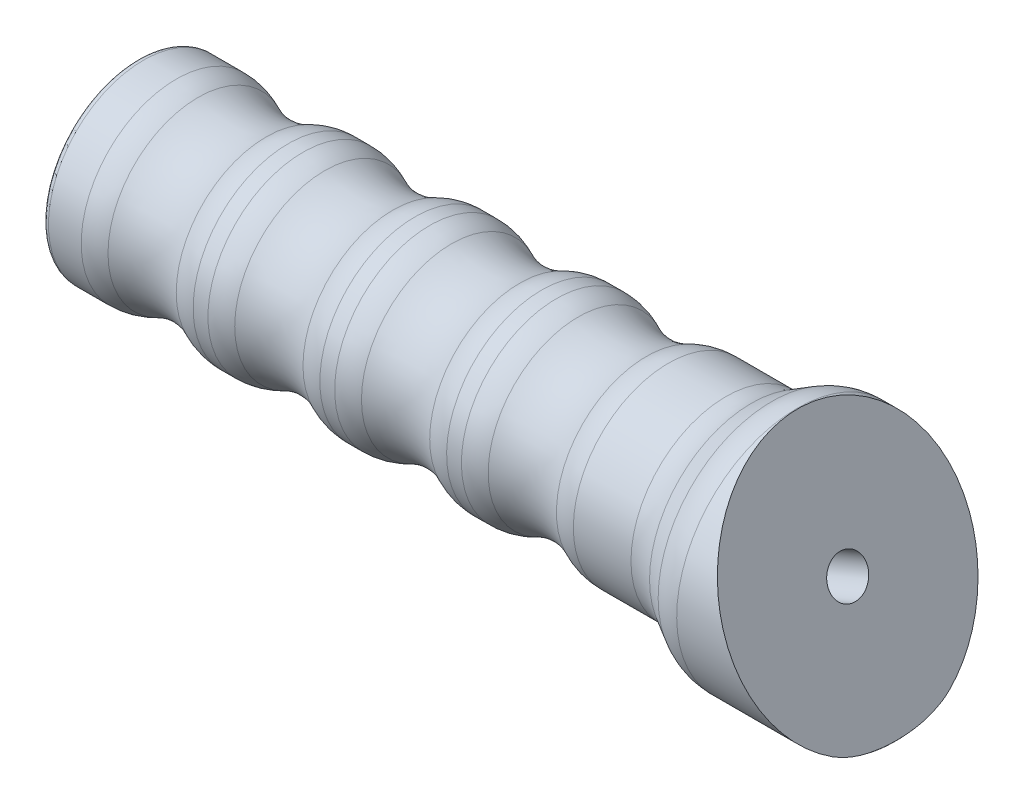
ISO-10303-21;
HEADER;
FILE_DESCRIPTION(('STEP AP214'),'2;1');
FILE_NAME('part.step','',(''),(''),'','','');
FILE_SCHEMA(('AUTOMOTIVE_DESIGN { 1 0 10303 214 1 1 1 1 }'));
ENDSEC;
DATA;
#1=APPLICATION_CONTEXT('core data for automotive mechanical design processes');
#2=APPLICATION_PROTOCOL_DEFINITION('international standard','automotive_design',2000,#1);
#3=PRODUCT_CONTEXT('',#1,'mechanical');
#4=PRODUCT('Part','Part','',(#3));
#5=PRODUCT_RELATED_PRODUCT_CATEGORY('part','',(#4));
#6=PRODUCT_DEFINITION_FORMATION('','',#4);
#7=PRODUCT_DEFINITION_CONTEXT('part definition',#1,'design');
#8=PRODUCT_DEFINITION('design','',#6,#7);
#9=PRODUCT_DEFINITION_SHAPE('','',#8);
#10=(LENGTH_UNIT() NAMED_UNIT(*) SI_UNIT(.MILLI.,.METRE.));
#11=(NAMED_UNIT(*) PLANE_ANGLE_UNIT() SI_UNIT($,.RADIAN.));
#12=(NAMED_UNIT(*) SI_UNIT($,.STERADIAN.) SOLID_ANGLE_UNIT());
#13=UNCERTAINTY_MEASURE_WITH_UNIT(LENGTH_MEASURE(1.E-05),#10,'distance_accuracy_value','');
#14=(GEOMETRIC_REPRESENTATION_CONTEXT(3) GLOBAL_UNCERTAINTY_ASSIGNED_CONTEXT((#13)) GLOBAL_UNIT_ASSIGNED_CONTEXT((#10,
#11,#12)) REPRESENTATION_CONTEXT('',''));
#15=CARTESIAN_POINT('',(0.,0.,0.));
#16=DIRECTION('',(0.,0.,1.));
#17=DIRECTION('',(1.,0.,0.));
#18=AXIS2_PLACEMENT_3D('',#15,#16,#17);
#19=CARTESIAN_POINT('',(0.,0.,0.));
#20=DIRECTION('',(-1.,0.,0.));
#21=DIRECTION('',(0.,0.,1.));
#22=AXIS2_PLACEMENT_3D('',#19,#20,#21);
#23=CYLINDRICAL_SURFACE('',#22,15.);
#24=CARTESIAN_POINT('',(92.9282032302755,0.,0.));
#25=DIRECTION('',(-1.,0.,0.));
#26=DIRECTION('',(0.,0.,1.));
#27=AXIS2_PLACEMENT_3D('',#24,#25,#26);
#28=CIRCLE('',#27,15.);
#29=CARTESIAN_POINT('',(92.9282032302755,0.,15.));
#30=VERTEX_POINT('',#29);
#31=EDGE_CURVE('E321',#30,#30,#28,.T.);
#32=ORIENTED_EDGE('',*,*,#31,.T.);
#33=EDGE_LOOP('',(#32));
#34=FACE_BOUND('',#33,.T.);
#35=CARTESIAN_POINT('',(83.8317608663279,-14.1318424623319,-5.02901865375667));
#36=CARTESIAN_POINT('',(83.9859479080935,-14.1427237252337,-4.99843191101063));
#37=CARTESIAN_POINT('',(84.1397389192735,-14.1541565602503,-4.96599996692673));
#38=CARTESIAN_POINT('',(84.4463662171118,-14.1781353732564,-4.89712498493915));
#39=CARTESIAN_POINT('',(84.5992022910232,-14.190681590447,-4.86068108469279));
#40=CARTESIAN_POINT('',(84.9042731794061,-14.2169426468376,-4.78332665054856));
#41=CARTESIAN_POINT('',(85.0565034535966,-14.2306617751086,-4.74239955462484));
#42=CARTESIAN_POINT('',(85.3594961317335,-14.2592185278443,-4.65583008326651));
#43=CARTESIAN_POINT('',(85.510258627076,-14.2740560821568,-4.61018800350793));
#44=CARTESIAN_POINT('',(85.96396634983,-14.3206395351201,-4.46429182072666));
#45=CARTESIAN_POINT('',(86.2642400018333,-14.3541050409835,-4.35607868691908));
#46=CARTESIAN_POINT('',(86.8537919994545,-14.425121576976,-4.11481943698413));
#47=CARTESIAN_POINT('',(87.1430881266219,-14.4626655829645,-3.98181574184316));
#48=CARTESIAN_POINT('',(87.5546196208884,-14.5198549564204,-3.76546878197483));
#49=CARTESIAN_POINT('',(87.6831893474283,-14.5382926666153,-3.69378166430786));
#50=CARTESIAN_POINT('',(87.9361637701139,-14.5756620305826,-3.54345827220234));
#51=CARTESIAN_POINT('',(88.060568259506,-14.5945937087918,-3.46482165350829));
#52=CARTESIAN_POINT('',(88.3041998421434,-14.6327151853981,-3.30011846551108));
#53=CARTESIAN_POINT('',(88.4234307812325,-14.6519047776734,-3.21405756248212));
#54=CARTESIAN_POINT('',(88.6557008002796,-14.6902648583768,-3.03390859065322));
#55=CARTESIAN_POINT('',(88.7687399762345,-14.7094353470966,-2.93982064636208));
#56=CARTESIAN_POINT('',(88.9890586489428,-14.7476941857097,-2.74151039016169));
#57=CARTESIAN_POINT('',(89.0962132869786,-14.7667760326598,-2.63714718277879));
#58=CARTESIAN_POINT('',(89.3010036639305,-14.8040394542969,-2.41922221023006));
#59=CARTESIAN_POINT('',(89.3986376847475,-14.8222208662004,-2.30565879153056));
#60=CARTESIAN_POINT('',(89.5820187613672,-14.857016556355,-2.06959734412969));
#61=CARTESIAN_POINT('',(89.6678026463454,-14.8736356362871,-1.94712888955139));
#62=CARTESIAN_POINT('',(89.8254638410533,-14.9046573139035,-1.69337505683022));
#63=CARTESIAN_POINT('',(89.8973523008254,-14.9190616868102,-1.56209686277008));
#64=CARTESIAN_POINT('',(90.0396019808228,-14.9479051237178,-1.26018033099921));
#65=CARTESIAN_POINT('',(90.1057805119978,-14.9615847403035,-1.08745117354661));
#66=CARTESIAN_POINT('',(90.2091298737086,-14.9831193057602,-0.733180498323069));
#67=CARTESIAN_POINT('',(90.2463198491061,-14.9909780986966,-0.551644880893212));
#68=CARTESIAN_POINT('',(90.2889738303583,-15.0000018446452,-0.183965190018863));
#69=CARTESIAN_POINT('',(90.2943202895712,-15.0011419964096,0.00219341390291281));
#70=CARTESIAN_POINT('',(90.2725113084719,-14.9965180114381,0.372498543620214));
#71=CARTESIAN_POINT('',(90.2453521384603,-14.9907530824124,0.556644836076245));
#72=CARTESIAN_POINT('',(90.162794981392,-14.9734426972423,0.908633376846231));
#73=CARTESIAN_POINT('',(90.1088295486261,-14.9621909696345,1.07683325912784));
#74=CARTESIAN_POINT('',(89.976911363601,-14.9351353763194,1.40306137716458));
#75=CARTESIAN_POINT('',(89.898949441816,-14.9193297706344,1.56108569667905));
#76=CARTESIAN_POINT('',(89.6829860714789,-14.8764540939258,1.93406859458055));
#77=CARTESIAN_POINT('',(89.5337932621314,-14.8475269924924,2.14232506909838));
#78=CARTESIAN_POINT('',(89.2043438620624,-14.7860906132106,2.53193514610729));
#79=CARTESIAN_POINT('',(89.024025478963,-14.7535742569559,2.71323387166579));
#80=CARTESIAN_POINT('',(88.6836597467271,-14.6948570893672,3.01314095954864));
#81=CARTESIAN_POINT('',(88.5279015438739,-14.6688435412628,3.13676014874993));
#82=CARTESIAN_POINT('',(88.2060368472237,-14.617048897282,3.36989061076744));
#83=CARTESIAN_POINT('',(88.0399239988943,-14.5912679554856,3.47939309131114));
#84=CARTESIAN_POINT('',(87.6990643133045,-14.5404415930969,3.68604471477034));
#85=CARTESIAN_POINT('',(87.524280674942,-14.5154001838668,3.78313358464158));
#86=CARTESIAN_POINT('',(87.1685748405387,-14.4665792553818,3.96572876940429));
#87=CARTESIAN_POINT('',(86.9876508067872,-14.4428001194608,4.05123157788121));
#88=CARTESIAN_POINT('',(86.5652829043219,-14.3897718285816,4.23631683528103));
#89=CARTESIAN_POINT('',(86.322181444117,-14.3610610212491,4.33226223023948));
#90=CARTESIAN_POINT('',(85.8300989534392,-14.3065766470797,4.50892267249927));
#91=CARTESIAN_POINT('',(85.5811145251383,-14.2808048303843,4.58962866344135));
#92=CARTESIAN_POINT('',(85.0834608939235,-14.2327865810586,4.73641588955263));
#93=CARTESIAN_POINT('',(84.8348663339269,-14.210485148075,4.80273374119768));
#94=CARTESIAN_POINT('',(84.4599652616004,-14.1793001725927,4.89371641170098));
#95=CARTESIAN_POINT('',(84.3347559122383,-14.1692895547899,4.92261020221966));
#96=CARTESIAN_POINT('',(84.0837091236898,-14.1500109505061,4.97775438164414));
#97=CARTESIAN_POINT('',(83.9578717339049,-14.1407429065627,5.00400497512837));
#98=CARTESIAN_POINT('',(83.8317608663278,-14.131842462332,5.02901865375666));
#99=B_SPLINE_CURVE_WITH_KNOTS('',3,(#35,#36,#37,#38,#39,#40,#41,#42,#43,#44,#45,#46,#47,#48,#49,
#50,#51,#52,#53,#54,#55,#56,#57,#58,#59,#60,#61,#62,#63,#64,#65,#66,#67,#68,#69,#70,#71,#72,#73,
#74,#75,#76,#77,#78,#79,#80,#81,#82,#83,#84,#85,#86,#87,#88,#89,#90,#91,#92,#93,#94,#95,#96,#97,
#98),.UNSPECIFIED.,.F.,.F.,(4,2,2,2,2,2,2,2,2,2,2,2,2,2,2,2,2,2,2,2,2,2,2,2,2,2,2,2,2,2,2,4),
(0.,0.472703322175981,0.945508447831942,1.42012322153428,1.89470825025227,2.85654037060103,
3.81674149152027,4.26162743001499,4.70653541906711,5.15110680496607,5.59567129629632,
6.04752650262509,6.49946310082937,6.94996190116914,7.40009769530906,7.95413522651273,
8.50780654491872,9.0635204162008,9.61929805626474,10.148136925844,10.67717812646,
11.4462751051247,12.2169168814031,12.8177390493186,13.4189336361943,14.022944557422,
14.6271378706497,15.4152517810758,16.2038325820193,16.9782512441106,17.3648939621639,
17.7515067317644),.UNSPECIFIED.);
#100=CARTESIAN_POINT('',(83.8317608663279,-14.1318424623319,-5.02901865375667));
#101=VERTEX_POINT('',#100);
#102=CARTESIAN_POINT('',(83.8317608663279,-14.1318424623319,5.02901865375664));
#103=VERTEX_POINT('',#102);
#104=EDGE_CURVE('E186',#101,#103,#99,.T.);
#105=ORIENTED_EDGE('',*,*,#104,.F.);
#106=CARTESIAN_POINT('',(83.8317608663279,0.,0.));
#107=DIRECTION('',(1.,0.,0.));
#108=DIRECTION('',(0.,0.,-1.));
#109=AXIS2_PLACEMENT_3D('',#106,#107,#108);
#110=CIRCLE('',#109,15.);
#111=EDGE_CURVE('E318',#101,#103,#110,.T.);
#112=ORIENTED_EDGE('',*,*,#111,.T.);
#113=EDGE_LOOP('',(#105,#112));
#114=FACE_BOUND('',#113,.T.);
#115=ADVANCED_FACE('F32',(#34,#114),#23,.T.);
#116=CARTESIAN_POINT('',(75.,0.,0.));
#117=DIRECTION('',(-1.,0.,0.));
#118=DIRECTION('',(0.,0.,1.));
#119=AXIS2_PLACEMENT_3D('',#116,#117,#118);
#120=TOROIDAL_SURFACE('',#119,25.5,12.5);
#121=CARTESIAN_POINT('',(80.3854200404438,-13.1129079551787,5.49989885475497));
#122=CARTESIAN_POINT('',(80.2801782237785,-13.0586427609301,5.49934921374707));
#123=CARTESIAN_POINT('',(80.1737990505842,-13.0066538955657,5.49658331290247));
#124=CARTESIAN_POINT('',(79.9591242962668,-12.9073040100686,5.48709815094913));
#125=CARTESIAN_POINT('',(79.8508295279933,-12.8599410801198,5.48038052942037));
#126=CARTESIAN_POINT('',(79.6329002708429,-12.7699995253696,5.46349356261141));
#127=CARTESIAN_POINT('',(79.5232703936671,-12.7274078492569,5.45333395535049));
#128=CARTESIAN_POINT('',(79.3026460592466,-12.646827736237,5.4300096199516));
#129=CARTESIAN_POINT('',(79.1916514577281,-12.60883979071,5.4168445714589));
#130=CARTESIAN_POINT('',(78.8596620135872,-12.5025469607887,5.3738360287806));
#131=CARTESIAN_POINT('',(78.6370105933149,-12.4408279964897,5.34025278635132));
#132=CARTESIAN_POINT('',(78.1887813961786,-12.3342224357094,5.26599919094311));
#133=CARTESIAN_POINT('',(77.9632012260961,-12.2893506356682,5.22532265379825));
#134=CARTESIAN_POINT('',(77.4166793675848,-12.2000470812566,5.12166789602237));
#135=CARTESIAN_POINT('',(77.0948776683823,-12.1634702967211,5.05642311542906));
#136=CARTESIAN_POINT('',(76.4500611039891,-12.1185366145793,4.92273360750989));
#137=CARTESIAN_POINT('',(76.1270459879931,-12.1101859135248,4.85428818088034));
#138=CARTESIAN_POINT('',(75.4785828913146,-12.1189279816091,4.71841436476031));
#139=CARTESIAN_POINT('',(75.1531353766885,-12.1362176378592,4.65099790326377));
#140=CARTESIAN_POINT('',(74.503202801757,-12.1944117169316,4.52196858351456));
#141=CARTESIAN_POINT('',(74.178717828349,-12.235318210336,4.46035623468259));
#142=CARTESIAN_POINT('',(73.4904314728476,-12.345821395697,4.33965688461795));
#143=CARTESIAN_POINT('',(73.1268738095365,-12.4184033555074,4.28188573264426));
#144=CARTESIAN_POINT('',(72.4037231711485,-12.5902668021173,4.18404098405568));
#145=CARTESIAN_POINT('',(72.0441288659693,-12.6895390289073,4.14396126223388));
#146=CARTESIAN_POINT('',(71.5109561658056,-12.8573971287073,4.10052904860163));
#147=CARTESIAN_POINT('',(71.3349243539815,-12.9162495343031,4.08884600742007));
#148=CARTESIAN_POINT('',(70.98478992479,-13.0402550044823,4.07128898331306));
#149=CARTESIAN_POINT('',(70.8106872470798,-13.1054078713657,4.06541481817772));
#150=CARTESIAN_POINT('',(70.464582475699,-13.2420347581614,4.05974095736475));
#151=CARTESIAN_POINT('',(70.2925838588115,-13.3135179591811,4.05995023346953));
#152=CARTESIAN_POINT('',(69.9513727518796,-13.4626568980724,4.06651076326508));
#153=CARTESIAN_POINT('',(69.7821606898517,-13.5403135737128,4.07286295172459));
#154=CARTESIAN_POINT('',(69.6145799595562,-13.6210129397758,4.08230926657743));
#155=B_SPLINE_CURVE_WITH_KNOTS('',3,(#121,#122,#123,#124,#125,#126,#127,#128,#129,#130,#131,
#132,#133,#134,#135,#136,#137,#138,#139,#140,#141,#142,#143,#144,#145,#146,#147,#148,#149,#150,
#151,#152,#153,#154),.UNSPECIFIED.,.F.,.F.,(4,2,2,2,2,2,2,2,2,2,2,2,2,2,2,2,4),(0.,
0.355148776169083,0.710150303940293,1.0641557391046,1.41819892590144,2.11769816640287,
2.81781033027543,3.80743247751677,4.79727186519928,5.79475149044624,6.79231858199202,
7.91665266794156,9.04059717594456,9.59835472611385,10.1560947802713,10.7146574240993,
11.2733050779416),.UNSPECIFIED.);
#156=CARTESIAN_POINT('',(80.3852200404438,-13.1128048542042,5.49989781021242));
#157=VERTEX_POINT('',#156);
#158=CARTESIAN_POINT('',(69.6147799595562,-13.6209166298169,4.08229803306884));
#159=VERTEX_POINT('',#158);
#160=EDGE_CURVE('E52',#157,#159,#155,.T.);
#161=ORIENTED_EDGE('',*,*,#160,.F.);
#162=CARTESIAN_POINT('',(80.3852200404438,0.,0.));
#163=DIRECTION('',(-1.,0.,0.));
#164=DIRECTION('',(0.,0.,1.));
#165=AXIS2_PLACEMENT_3D('',#162,#163,#164);
#166=CIRCLE('',#165,14.2195121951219);
#167=CARTESIAN_POINT('',(80.3852200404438,-13.1128048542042,-5.49989781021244));
#168=VERTEX_POINT('',#167);
#169=EDGE_CURVE('E116',#157,#168,#166,.T.);
#170=ORIENTED_EDGE('',*,*,#169,.T.);
#171=CARTESIAN_POINT('',(69.6145799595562,-13.6210129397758,-4.08230926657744));
#172=CARTESIAN_POINT('',(69.7632804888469,-13.5494051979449,-4.07393583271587));
#173=CARTESIAN_POINT('',(69.9132663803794,-13.4801930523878,-4.06798794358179));
#174=CARTESIAN_POINT('',(70.215478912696,-13.3466207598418,-4.06093065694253));
#175=CARTESIAN_POINT('',(70.3677053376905,-13.2822601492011,-4.05982079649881));
#176=CARTESIAN_POINT('',(70.6739255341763,-13.1585075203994,-4.06242390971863));
#177=CARTESIAN_POINT('',(70.8279171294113,-13.0991100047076,-4.06613146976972));
#178=CARTESIAN_POINT('',(71.1375281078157,-12.9852595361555,-4.07820353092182));
#179=CARTESIAN_POINT('',(71.2931475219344,-12.9308066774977,-4.08656812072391));
#180=CARTESIAN_POINT('',(71.7619014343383,-12.7749879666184,-4.11830601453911));
#181=CARTESIAN_POINT('',(72.077118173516,-12.6810867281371,-4.14832552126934));
#182=CARTESIAN_POINT('',(72.711182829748,-12.5137310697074,-4.22334682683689));
#183=CARTESIAN_POINT('',(73.0300317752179,-12.4402825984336,-4.26835297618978));
#184=CARTESIAN_POINT('',(73.6790733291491,-12.3128105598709,-4.37132461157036));
#185=CARTESIAN_POINT('',(74.0093324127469,-12.259392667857,-4.42961953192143));
#186=CARTESIAN_POINT('',(74.6713425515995,-12.1762594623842,-4.55434529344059));
#187=CARTESIAN_POINT('',(75.0030938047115,-12.1465473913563,-4.62077724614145));
#188=CARTESIAN_POINT('',(75.6673621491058,-12.1127955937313,-4.75749202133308));
#189=CARTESIAN_POINT('',(75.9998795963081,-12.1087724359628,-4.82777729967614));
#190=CARTESIAN_POINT('',(76.6642108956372,-12.1291811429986,-4.96733467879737));
#191=CARTESIAN_POINT('',(76.9960250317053,-12.1535975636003,-5.03660730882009));
#192=CARTESIAN_POINT('',(77.5479011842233,-12.2209040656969,-5.14659030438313));
#193=CARTESIAN_POINT('',(77.7686681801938,-12.2550264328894,-5.18917624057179));
#194=CARTESIAN_POINT('',(78.2083133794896,-12.3386297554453,-5.26919969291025));
#195=CARTESIAN_POINT('',(78.4271913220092,-12.3881127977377,-5.30663650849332));
#196=CARTESIAN_POINT('',(78.8607758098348,-12.5031429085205,-5.37371136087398));
#197=CARTESIAN_POINT('',(79.0754974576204,-12.568610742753,-5.40338641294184));
#198=CARTESIAN_POINT('',(79.5001889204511,-12.716402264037,-5.45230367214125));
#199=CARTESIAN_POINT('',(79.7101629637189,-12.7987102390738,-5.47155554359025));
#200=CARTESIAN_POINT('',(79.9958968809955,-12.9242268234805,-5.48877518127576));
#201=CARTESIAN_POINT('',(80.0745353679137,-12.9602276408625,-5.49254632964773));
#202=CARTESIAN_POINT('',(80.2307902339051,-13.0347153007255,-5.49790837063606));
#203=CARTESIAN_POINT('',(80.3084055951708,-13.0732044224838,-5.49949723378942));
#204=CARTESIAN_POINT('',(80.3854200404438,-13.1129079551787,-5.49989885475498));
#205=B_SPLINE_CURVE_WITH_KNOTS('',3,(#171,#172,#173,#174,#175,#176,#177,#178,#179,#180,#181,
#182,#183,#184,#185,#186,#187,#188,#189,#190,#191,#192,#193,#194,#195,#196,#197,#198,#199,#200,
#201,#202,#203,#204),.UNSPECIFIED.,.F.,.F.,(4,2,2,2,2,2,2,2,2,2,2,2,2,2,2,2,4),(0.,
0.495721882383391,0.991396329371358,1.48651423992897,1.98164158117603,2.97129459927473,
3.9612351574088,4.97907035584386,5.99704474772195,7.01567564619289,8.03375363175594,
8.71549928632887,9.3973376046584,10.075862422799,10.753757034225,11.0134084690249,
11.273301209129),.UNSPECIFIED.);
#206=CARTESIAN_POINT('',(69.6147799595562,-13.620916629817,-4.08229803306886));
#207=VERTEX_POINT('',#206);
#208=EDGE_CURVE('E227',#207,#168,#205,.T.);
#209=ORIENTED_EDGE('',*,*,#208,.F.);
#210=CARTESIAN_POINT('',(69.6147799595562,0.,0.));
#211=DIRECTION('',(1.,0.,0.));
#212=DIRECTION('',(0.,0.,-1.));
#213=AXIS2_PLACEMENT_3D('',#210,#211,#212);
#214=CIRCLE('',#213,14.2195121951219);
#215=EDGE_CURVE('E108',#207,#159,#214,.T.);
#216=ORIENTED_EDGE('',*,*,#215,.T.);
#217=EDGE_LOOP('',(#161,#170,#209,#216));
#218=FACE_BOUND('',#217,.T.);
#219=ADVANCED_FACE('F170',(#218),#120,.F.);
#220=CARTESIAN_POINT('',(0.,0.,0.));
#221=DIRECTION('',(-1.,0.,0.));
#222=DIRECTION('',(0.,0.,1.));
#223=AXIS2_PLACEMENT_3D('',#220,#221,#222);
#224=CYLINDRICAL_SURFACE('',#223,15.);
#225=CARTESIAN_POINT('',(66.1682391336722,-14.5565173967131,3.62046975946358));
#226=CARTESIAN_POINT('',(65.9676657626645,-14.5738053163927,3.5508996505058));
#227=CARTESIAN_POINT('',(65.7680420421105,-14.591289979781,3.47853073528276));
#228=CARTESIAN_POINT('',(65.3716728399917,-14.6265260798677,3.3272920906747));
#229=CARTESIAN_POINT('',(65.1749232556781,-14.6442770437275,3.24843297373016));
#230=CARTESIAN_POINT('',(64.784605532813,-14.6799776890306,3.08308219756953));
#231=CARTESIAN_POINT('',(64.591037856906,-14.6979273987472,2.9965894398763));
#232=CARTESIAN_POINT('',(64.3037818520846,-14.7249028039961,2.85996382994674));
#233=CARTESIAN_POINT('',(64.2084698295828,-14.7339103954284,2.81323356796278));
#234=CARTESIAN_POINT('',(64.0191127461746,-14.7519145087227,2.71723926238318));
#235=CARTESIAN_POINT('',(63.9250678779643,-14.7609110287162,2.66797483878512));
#236=CARTESIAN_POINT('',(63.8317608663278,-14.7698890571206,2.6173225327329));
#237=B_SPLINE_CURVE_WITH_KNOTS('',3,(#225,#226,#227,#228,#229,#230,#231,#232,#233,#234,#235,
#236),.UNSPECIFIED.,.F.,.F.,(4,2,2,2,2,4),(0.,0.639026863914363,1.27702882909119,
1.91512275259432,2.2346877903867,2.55430088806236),.UNSPECIFIED.);
#238=CARTESIAN_POINT('',(66.1682391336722,-14.556517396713,3.62046975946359));
#239=VERTEX_POINT('',#238);
#240=CARTESIAN_POINT('',(63.8317608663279,-14.7698890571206,2.61732253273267));
#241=VERTEX_POINT('',#240);
#242=EDGE_CURVE('E89',#239,#241,#237,.T.);
#243=ORIENTED_EDGE('',*,*,#242,.F.);
#244=CARTESIAN_POINT('',(66.1682391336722,0.,0.));
#245=DIRECTION('',(1.,0.,0.));
#246=DIRECTION('',(0.,0.,-1.));
#247=AXIS2_PLACEMENT_3D('',#244,#245,#246);
#248=CIRCLE('',#247,15.);
#249=CARTESIAN_POINT('',(66.1682391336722,-14.556517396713,-3.62046975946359));
#250=VERTEX_POINT('',#249);
#251=EDGE_CURVE('E101',#239,#250,#248,.F.);
#252=ORIENTED_EDGE('',*,*,#251,.T.);
#253=CARTESIAN_POINT('',(63.8317608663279,-14.7698890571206,-2.61732253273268));
#254=CARTESIAN_POINT('',(63.9250678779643,-14.7609110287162,-2.66797483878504));
#255=CARTESIAN_POINT('',(64.0191127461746,-14.7519145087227,-2.71723926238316));
#256=CARTESIAN_POINT('',(64.2084698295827,-14.7339103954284,-2.8132335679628));
#257=CARTESIAN_POINT('',(64.3037818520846,-14.7249028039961,-2.85996382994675));
#258=CARTESIAN_POINT('',(64.591037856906,-14.6979273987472,-2.99658943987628));
#259=CARTESIAN_POINT('',(64.784605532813,-14.6799776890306,-3.08308219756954));
#260=CARTESIAN_POINT('',(65.1749232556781,-14.6442770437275,-3.24843297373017));
#261=CARTESIAN_POINT('',(65.3716728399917,-14.6265260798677,-3.32729209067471));
#262=CARTESIAN_POINT('',(65.7680420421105,-14.591289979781,-3.47853073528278));
#263=CARTESIAN_POINT('',(65.9676657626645,-14.5738053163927,-3.55089965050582));
#264=CARTESIAN_POINT('',(66.1682391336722,-14.556517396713,-3.62046975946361));
#265=B_SPLINE_CURVE_WITH_KNOTS('',3,(#253,#254,#255,#256,#257,#258,#259,#260,#261,#262,#263,
#264),.UNSPECIFIED.,.F.,.F.,(4,2,2,2,2,4),(0.,0.31961309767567,0.639178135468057,
1.27727205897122,1.91527402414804,2.55430088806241),.UNSPECIFIED.);
#266=CARTESIAN_POINT('',(63.8317608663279,-14.7698890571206,-2.61732253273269));
#267=VERTEX_POINT('',#266);
#268=EDGE_CURVE('E180',#267,#250,#265,.T.);
#269=ORIENTED_EDGE('',*,*,#268,.F.);
#270=CARTESIAN_POINT('',(63.8317608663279,0.,0.));
#271=DIRECTION('',(1.,0.,0.));
#272=DIRECTION('',(0.,0.,-1.));
#273=AXIS2_PLACEMENT_3D('',#270,#271,#272);
#274=CIRCLE('',#273,15.);
#275=EDGE_CURVE('E103',#267,#241,#274,.T.);
#276=ORIENTED_EDGE('',*,*,#275,.T.);
#277=EDGE_LOOP('',(#243,#252,#269,#276));
#278=FACE_BOUND('',#277,.T.);
#279=ADVANCED_FACE('F99',(#278),#224,.T.);
#280=CARTESIAN_POINT('',(63.8317608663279,0.,0.));
#281=DIRECTION('',(1.,0.,0.));
#282=DIRECTION('',(0.,0.,-1.));
#283=AXIS2_PLACEMENT_3D('',#280,#281,#282);
#284=DEGENERATE_TOROIDAL_SURFACE('',#283,7.,8.,.T.);
#285=CARTESIAN_POINT('',(60.3852200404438,0.,0.));
#286=DIRECTION('',(-1.,0.,0.));
#287=DIRECTION('',(0.,0.,1.));
#288=AXIS2_PLACEMENT_3D('',#285,#286,#287);
#289=CIRCLE('',#288,14.219512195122);
#290=CARTESIAN_POINT('',(60.3852200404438,0.,14.219512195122));
#291=VERTEX_POINT('',#290);
#292=EDGE_CURVE('E106',#291,#291,#289,.T.);
#293=ORIENTED_EDGE('',*,*,#292,.F.);
#294=EDGE_LOOP('',(#293));
#295=FACE_BOUND('',#294,.T.);
#296=ORIENTED_EDGE('',*,*,#275,.F.);
#297=CARTESIAN_POINT('',(63.8319608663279,-14.769869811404,-2.61743112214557));
#298=CARTESIAN_POINT('',(63.7536671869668,-14.7774077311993,-2.5749166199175));
#299=CARTESIAN_POINT('',(63.6764837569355,-14.7839723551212,-2.53021235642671));
#300=CARTESIAN_POINT('',(63.5247652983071,-14.7953140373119,-2.43618447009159));
#301=CARTESIAN_POINT('',(63.4502324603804,-14.800089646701,-2.38685714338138));
#302=CARTESIAN_POINT('',(63.2301722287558,-14.8120249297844,-2.23078892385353));
#303=CARTESIAN_POINT('',(63.0895634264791,-14.8166669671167,-2.11669395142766));
#304=CARTESIAN_POINT('',(62.8264142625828,-14.8209690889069,-1.86783009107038));
#305=CARTESIAN_POINT('',(62.7039661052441,-14.8206045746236,-1.73296234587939));
#306=CARTESIAN_POINT('',(62.4849454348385,-14.8170651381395,-1.44417056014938));
#307=CARTESIAN_POINT('',(62.3882686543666,-14.8139017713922,-1.29032710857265));
#308=CARTESIAN_POINT('',(62.2439136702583,-14.8079032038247,-1.00039942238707));
#309=CARTESIAN_POINT('',(62.1902207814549,-14.8051372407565,-0.867306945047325));
#310=CARTESIAN_POINT('',(62.1058240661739,-14.8004400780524,-0.593888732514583));
#311=CARTESIAN_POINT('',(62.0751224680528,-14.7985089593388,-0.453562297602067));
#312=CARTESIAN_POINT('',(62.038591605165,-14.7961825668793,-0.169315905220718));
#313=CARTESIAN_POINT('',(62.0328232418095,-14.7957910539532,-0.0253880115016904));
#314=CARTESIAN_POINT('',(62.0466998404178,-14.7966958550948,0.261221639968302));
#315=CARTESIAN_POINT('',(62.0663444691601,-14.7979921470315,0.403903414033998));
#316=CARTESIAN_POINT('',(62.1284454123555,-14.8017210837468,0.67782027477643));
#317=CARTESIAN_POINT('',(62.1699097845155,-14.8041037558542,0.809284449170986));
#318=CARTESIAN_POINT('',(62.2727469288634,-14.8091626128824,1.06405132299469));
#319=CARTESIAN_POINT('',(62.3341149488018,-14.8118387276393,1.18735596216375));
#320=CARTESIAN_POINT('',(62.4793655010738,-14.8166369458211,1.4329769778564));
#321=CARTESIAN_POINT('',(62.5646250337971,-14.8186999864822,1.55447505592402));
#322=CARTESIAN_POINT('',(62.7513845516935,-14.820664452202,1.78454693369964));
#323=CARTESIAN_POINT('',(62.8529199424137,-14.8205610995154,1.89309163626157));
#324=CARTESIAN_POINT('',(63.0914587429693,-14.816604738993,2.1182455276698));
#325=CARTESIAN_POINT('',(63.2314222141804,-14.8119635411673,2.23170734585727));
#326=CARTESIAN_POINT('',(63.4506818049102,-14.8000620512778,2.38715981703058));
#327=CARTESIAN_POINT('',(63.5251351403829,-14.7952885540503,2.43642210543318));
#328=CARTESIAN_POINT('',(63.6766772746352,-14.7839557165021,2.53032386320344));
#329=CARTESIAN_POINT('',(63.753763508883,-14.7773980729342,2.57496766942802));
#330=CARTESIAN_POINT('',(63.8319608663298,-14.7698698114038,2.61743112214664));
#331=B_SPLINE_CURVE_WITH_KNOTS('',3,(#297,#298,#299,#300,#301,#302,#303,#304,#305,#306,#307,
#308,#309,#310,#311,#312,#313,#314,#315,#316,#317,#318,#319,#320,#321,#322,#323,#324,#325,#326,
#327,#328,#329,#330),.UNSPECIFIED.,.F.,.F.,(4,2,2,2,2,2,2,2,2,2,2,2,2,2,2,2,4),(0.,
0.26815395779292,0.536524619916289,1.07793328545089,1.62200300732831,2.16383688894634,
2.59262097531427,3.02144661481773,3.45131910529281,3.88118595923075,4.29301249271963,
4.70474076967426,5.1484007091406,5.59303919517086,6.13169006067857,6.39975994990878,
6.66757578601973),.UNSPECIFIED.);
#332=EDGE_CURVE('E187',#267,#241,#331,.T.);
#333=ORIENTED_EDGE('',*,*,#332,.T.);
#334=EDGE_LOOP('',(#296,#333));
#335=FACE_BOUND('',#334,.T.);
#336=ADVANCED_FACE('F169',(#295,#335),#284,.T.);
#337=CARTESIAN_POINT('',(83.8317608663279,0.,0.));
#338=DIRECTION('',(1.,0.,0.));
#339=DIRECTION('',(0.,0.,-1.));
#340=AXIS2_PLACEMENT_3D('',#337,#338,#339);
#341=DEGENERATE_TOROIDAL_SURFACE('',#340,7.,8.,.T.);
#342=ORIENTED_EDGE('',*,*,#111,.F.);
#343=CARTESIAN_POINT('',(83.8319608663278,-14.1318565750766,-5.0289789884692));
#344=CARTESIAN_POINT('',(83.7164572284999,-14.1237051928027,-5.05188978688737));
#345=CARTESIAN_POINT('',(83.6011990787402,-14.1127929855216,-5.07492845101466));
#346=CARTESIAN_POINT('',(83.3712604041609,-14.0856695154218,-5.12071176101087));
#347=CARTESIAN_POINT('',(83.2565798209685,-14.0694587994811,-5.1434564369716));
#348=CARTESIAN_POINT('',(82.9133755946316,-14.013189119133,-5.21045627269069));
#349=CARTESIAN_POINT('',(82.6858139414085,-13.9655018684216,-5.25345140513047));
#350=CARTESIAN_POINT('',(82.2386124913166,-13.8526054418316,-5.33128622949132));
#351=CARTESIAN_POINT('',(82.0189049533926,-13.7877600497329,-5.36626992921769));
#352=CARTESIAN_POINT('',(81.5837142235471,-13.6416338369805,-5.42574925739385));
#353=CARTESIAN_POINT('',(81.3682277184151,-13.5603665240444,-5.45025345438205));
#354=CARTESIAN_POINT('',(81.0252119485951,-13.4173570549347,-5.4788048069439));
#355=CARTESIAN_POINT('',(80.896055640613,-13.36030647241,-5.48710141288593));
#356=CARTESIAN_POINT('',(80.639178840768,-13.2405880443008,-5.49799895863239));
#357=CARTESIAN_POINT('',(80.5114717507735,-13.177888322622,-5.50056515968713));
#358=CARTESIAN_POINT('',(80.3850200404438,-13.1127017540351,-5.4998967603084));
#359=B_SPLINE_CURVE_WITH_KNOTS('',3,(#343,#344,#345,#346,#347,#348,#349,#350,#351,#352,#353,
#354,#355,#356,#357,#358),.UNSPECIFIED.,.F.,.F.,(4,2,2,2,2,2,2,4),(0.,0.354030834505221,
0.708025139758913,1.41639475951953,2.11080603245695,2.80464843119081,3.22875437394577,
3.65542442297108),.UNSPECIFIED.);
#360=EDGE_CURVE('E222',#101,#168,#359,.T.);
#361=ORIENTED_EDGE('',*,*,#360,.T.);
#362=ORIENTED_EDGE('',*,*,#169,.F.);
#363=CARTESIAN_POINT('',(80.3850200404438,-13.1127017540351,5.49989676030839));
#364=CARTESIAN_POINT('',(80.5953122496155,-13.221106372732,5.50104419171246));
#365=CARTESIAN_POINT('',(80.8090420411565,-13.3226194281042,5.49318734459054));
#366=CARTESIAN_POINT('',(81.2420942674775,-13.5102653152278,5.46270402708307));
#367=CARTESIAN_POINT('',(81.4614154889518,-13.5964014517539,5.44008073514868));
#368=CARTESIAN_POINT('',(81.9002706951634,-13.7502756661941,5.38383801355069));
#369=CARTESIAN_POINT('',(82.1197222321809,-13.8183308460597,5.35043460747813));
#370=CARTESIAN_POINT('',(82.5619768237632,-13.936688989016,5.27590054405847));
#371=CARTESIAN_POINT('',(82.7847781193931,-13.9870009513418,5.23477382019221));
#372=CARTESIAN_POINT('',(83.1448005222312,-14.0523458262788,5.16547601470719));
#373=CARTESIAN_POINT('',(83.2811860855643,-14.0734700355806,5.1385777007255));
#374=CARTESIAN_POINT('',(83.5555813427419,-14.108363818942,5.08405585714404));
#375=CARTESIAN_POINT('',(83.6935958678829,-14.1220901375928,5.05642903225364));
#376=CARTESIAN_POINT('',(83.8319608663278,-14.1318565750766,5.02897898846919));
#377=B_SPLINE_CURVE_WITH_KNOTS('',3,(#363,#364,#365,#366,#367,#368,#369,#370,#371,#372,#373,
#374,#375,#376),.UNSPECIFIED.,.F.,.F.,(4,2,2,2,2,2,4),(0.,0.709280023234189,1.41840742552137,
2.11412541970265,2.80949004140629,3.23113347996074,3.65521623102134),.UNSPECIFIED.);
#378=EDGE_CURVE('E216',#157,#103,#377,.T.);
#379=ORIENTED_EDGE('',*,*,#378,.T.);
#380=EDGE_LOOP('',(#342,#361,#362,#379));
#381=FACE_BOUND('',#380,.T.);
#382=ADVANCED_FACE('F232',(#381),#341,.T.);
#383=CARTESIAN_POINT('',(66.1682391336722,0.,0.));
#384=DIRECTION('',(1.,0.,0.));
#385=DIRECTION('',(0.,0.,-1.));
#386=AXIS2_PLACEMENT_3D('',#383,#384,#385);
#387=DEGENERATE_TOROIDAL_SURFACE('',#386,7.,8.,.T.);
#388=ORIENTED_EDGE('',*,*,#215,.F.);
#389=CARTESIAN_POINT('',(69.6149799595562,-13.6208203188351,-4.08228679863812));
#390=CARTESIAN_POINT('',(69.5078163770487,-13.6724327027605,-4.08829877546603));
#391=CARTESIAN_POINT('',(69.3996035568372,-13.7220919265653,-4.09231639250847));
#392=CARTESIAN_POINT('',(69.181349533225,-13.817400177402,-4.09638771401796));
#393=CARTESIAN_POINT('',(69.0713082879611,-13.8630491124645,-4.09644132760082));
#394=CARTESIAN_POINT('',(68.8495214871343,-13.9502899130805,-4.09260656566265));
#395=CARTESIAN_POINT('',(68.7377738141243,-13.9918761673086,-4.08871282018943));
#396=CARTESIAN_POINT('',(68.5130246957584,-14.0708489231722,-4.07693579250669));
#397=CARTESIAN_POINT('',(68.4000232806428,-14.1082355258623,-4.06905260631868));
#398=CARTESIAN_POINT('',(68.0655415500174,-14.2121717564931,-4.03982654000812));
#399=CARTESIAN_POINT('',(67.8426671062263,-14.2728122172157,-4.01280696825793));
#400=CARTESIAN_POINT('',(67.3959313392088,-14.3779021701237,-3.94226175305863));
#401=CARTESIAN_POINT('',(67.1720714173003,-14.4223698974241,-3.89875481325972));
#402=CARTESIAN_POINT('',(66.8837920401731,-14.4697338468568,-3.83070721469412));
#403=CARTESIAN_POINT('',(66.8184890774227,-14.4798014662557,-3.81448932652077));
#404=CARTESIAN_POINT('',(66.6881276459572,-14.4986096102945,-3.78042938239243));
#405=CARTESIAN_POINT('',(66.6230691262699,-14.5073504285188,-3.76258768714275));
#406=CARTESIAN_POINT('',(66.4273572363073,-14.5317484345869,-3.70624119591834));
#407=CARTESIAN_POINT('',(66.297192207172,-14.5454138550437,-3.66515418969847));
#408=CARTESIAN_POINT('',(66.1680391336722,-14.5565346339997,-3.62040044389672));
#409=B_SPLINE_CURVE_WITH_KNOTS('',3,(#389,#390,#391,#392,#393,#394,#395,#396,#397,#398,#399,
#400,#401,#402,#403,#404,#405,#406,#407,#408),.UNSPECIFIED.,.F.,.F.,(4,2,2,2,2,2,2,2,2,4),(0.,
0.357247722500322,0.714503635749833,1.07224620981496,1.42998017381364,2.12647025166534,
2.82217256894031,3.02625816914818,3.23029854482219,3.64156935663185),.UNSPECIFIED.);
#410=EDGE_CURVE('E11',#207,#250,#409,.T.);
#411=ORIENTED_EDGE('',*,*,#410,.T.);
#412=ORIENTED_EDGE('',*,*,#251,.F.);
#413=CARTESIAN_POINT('',(66.1680391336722,-14.5565346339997,3.62040044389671));
#414=CARTESIAN_POINT('',(66.2600396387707,-14.5486085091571,3.6522834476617));
#415=CARTESIAN_POINT('',(66.3525543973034,-14.539396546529,3.68230264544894));
#416=CARTESIAN_POINT('',(66.5383483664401,-14.5183204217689,3.73879256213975));
#417=CARTESIAN_POINT('',(66.6316274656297,-14.5064566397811,3.76526378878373));
#418=CARTESIAN_POINT('',(66.9121460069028,-14.4667783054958,3.83960807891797));
#419=CARTESIAN_POINT('',(67.1001745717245,-14.4348677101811,3.88244850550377));
#420=CARTESIAN_POINT('',(67.4724283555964,-14.3605453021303,3.95509996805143));
#421=CARTESIAN_POINT('',(67.6566518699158,-14.3183641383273,3.98516197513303));
#422=CARTESIAN_POINT('',(68.0237060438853,-14.2230536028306,4.03436852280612));
#423=CARTESIAN_POINT('',(68.2065369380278,-14.1699261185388,4.05351494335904));
#424=CARTESIAN_POINT('',(68.4920199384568,-14.0777931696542,4.0754728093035));
#425=CARTESIAN_POINT('',(68.5956082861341,-14.0424297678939,4.08176834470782));
#426=CARTESIAN_POINT('',(68.8016718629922,-13.9681658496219,4.09099918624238));
#427=CARTESIAN_POINT('',(68.904147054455,-13.929265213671,4.09393437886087));
#428=CARTESIAN_POINT('',(69.1089821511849,-13.847494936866,4.09648274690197));
#429=CARTESIAN_POINT('',(69.2113256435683,-13.8045829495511,4.0960552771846));
#430=CARTESIAN_POINT('',(69.4144095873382,-13.7152852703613,4.09175831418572));
#431=CARTESIAN_POINT('',(69.5151500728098,-13.668899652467,4.08788889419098));
#432=CARTESIAN_POINT('',(69.6149799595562,-13.6208203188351,4.08228679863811));
#433=B_SPLINE_CURVE_WITH_KNOTS('',3,(#413,#414,#415,#416,#417,#418,#419,#420,#421,#422,#423,
#424,#425,#426,#427,#428,#429,#430,#431,#432),.UNSPECIFIED.,.F.,.F.,(4,2,2,2,2,2,2,2,2,4),(0.,
0.2930087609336,0.585975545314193,1.17156739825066,1.74505729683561,2.318448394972,
2.64726805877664,2.97609882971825,3.3089102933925,3.64171467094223),.UNSPECIFIED.);
#434=EDGE_CURVE('E45',#239,#159,#433,.T.);
#435=ORIENTED_EDGE('',*,*,#434,.T.);
#436=EDGE_LOOP('',(#388,#411,#412,#435));
#437=FACE_BOUND('',#436,.T.);
#438=ADVANCED_FACE('F34',(#437),#387,.T.);
#439=CARTESIAN_POINT('',(0.,0.,0.));
#440=DIRECTION('',(-1.,0.,0.));
#441=DIRECTION('',(0.,0.,1.));
#442=AXIS2_PLACEMENT_3D('',#439,#440,#441);
#443=CYLINDRICAL_SURFACE('',#442,19.);
#444=CARTESIAN_POINT('',(104.143593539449,0.,0.));
#445=DIRECTION('',(1.,0.,0.));
#446=DIRECTION('',(0.,0.,-1.));
#447=AXIS2_PLACEMENT_3D('',#444,#445,#446);
#448=CIRCLE('',#447,19.);
#449=CARTESIAN_POINT('',(104.143593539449,0.,-19.));
#450=VERTEX_POINT('',#449);
#451=EDGE_CURVE('E297',#450,#450,#448,.T.);
#452=ORIENTED_EDGE('',*,*,#451,.T.);
#453=EDGE_LOOP('',(#452));
#454=FACE_BOUND('',#453,.T.);
#455=CARTESIAN_POINT('',(112.129942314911,0.,0.));
#456=DIRECTION('',(-0.923879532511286,-0.382683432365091,0.));
#457=DIRECTION('',(-0.382683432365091,0.923879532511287,0.));
#458=AXIS2_PLACEMENT_3D('',#455,#456,#457);
#459=ELLIPSE('',#458,20.5654518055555,19.);
#460=CARTESIAN_POINT('',(119.,-16.5857864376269,9.26885582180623));
#461=VERTEX_POINT('',#460);
#462=CARTESIAN_POINT('',(119.,-16.5857864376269,-9.26885582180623));
#463=VERTEX_POINT('',#462);
#464=EDGE_CURVE('E59',#461,#463,#459,.T.);
#465=ORIENTED_EDGE('',*,*,#464,.T.);
#466=CARTESIAN_POINT('',(119.,0.,0.));
#467=DIRECTION('',(-1.,0.,0.));
#468=DIRECTION('',(0.,0.,1.));
#469=AXIS2_PLACEMENT_3D('',#466,#467,#468);
#470=CIRCLE('',#469,19.);
#471=EDGE_CURVE('E300',#463,#461,#470,.T.);
#472=ORIENTED_EDGE('',*,*,#471,.T.);
#473=EDGE_LOOP('',(#465,#472));
#474=FACE_BOUND('',#473,.T.);
#475=ADVANCED_FACE('F287',(#454,#474),#443,.T.);
#476=CARTESIAN_POINT('',(102.,0.,0.));
#477=DIRECTION('',(1.,0.,0.));
#478=DIRECTION('',(0.,0.,-1.));
#479=AXIS2_PLACEMENT_3D('',#476,#477,#478);
#480=CONICAL_SURFACE('',#479,19.,0.5235987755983);
#481=CARTESIAN_POINT('',(100.143593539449,0.,0.));
#482=DIRECTION('',(-1.,0.,0.));
#483=DIRECTION('',(0.,0.,1.));
#484=AXIS2_PLACEMENT_3D('',#481,#482,#483);
#485=CIRCLE('',#484,17.9282032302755);
#486=CARTESIAN_POINT('',(100.143593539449,0.,17.9282032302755));
#487=VERTEX_POINT('',#486);
#488=EDGE_CURVE('E314',#487,#487,#485,.T.);
#489=ORIENTED_EDGE('',*,*,#488,.T.);
#490=EDGE_LOOP('',(#489));
#491=FACE_BOUND('',#490,.T.);
#492=CARTESIAN_POINT('',(96.9282032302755,0.,0.));
#493=DIRECTION('',(1.,0.,0.));
#494=DIRECTION('',(0.,0.,-1.));
#495=AXIS2_PLACEMENT_3D('',#492,#493,#494);
#496=CIRCLE('',#495,16.0717967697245);
#497=CARTESIAN_POINT('',(96.9282032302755,0.,-16.0717967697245));
#498=VERTEX_POINT('',#497);
#499=EDGE_CURVE('E311',#498,#498,#496,.T.);
#500=ORIENTED_EDGE('',*,*,#499,.T.);
#501=EDGE_LOOP('',(#500));
#502=FACE_BOUND('',#501,.T.);
#503=ADVANCED_FACE('F164',(#491,#502),#480,.T.);
#504=CARTESIAN_POINT('',(55.,0.,0.));
#505=DIRECTION('',(-1.,0.,0.));
#506=DIRECTION('',(0.,0.,1.));
#507=AXIS2_PLACEMENT_3D('',#504,#505,#506);
#508=TOROIDAL_SURFACE('',#507,25.5,12.5);
#509=ORIENTED_EDGE('',*,*,#292,.T.);
#510=EDGE_LOOP('',(#509));
#511=FACE_BOUND('',#510,.T.);
#512=CARTESIAN_POINT('',(49.6147799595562,0.,0.));
#513=DIRECTION('',(1.,0.,0.));
#514=DIRECTION('',(0.,0.,-1.));
#515=AXIS2_PLACEMENT_3D('',#512,#513,#514);
#516=CIRCLE('',#515,14.219512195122);
#517=CARTESIAN_POINT('',(49.6147799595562,0.,-14.219512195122));
#518=VERTEX_POINT('',#517);
#519=EDGE_CURVE('E111',#518,#518,#516,.T.);
#520=ORIENTED_EDGE('',*,*,#519,.T.);
#521=EDGE_LOOP('',(#520));
#522=FACE_BOUND('',#521,.T.);
#523=ADVANCED_FACE('F160',(#511,#522),#508,.F.);
#524=CARTESIAN_POINT('',(0.,0.,0.));
#525=DIRECTION('',(-1.,0.,0.));
#526=DIRECTION('',(0.,0.,1.));
#527=AXIS2_PLACEMENT_3D('',#524,#525,#526);
#528=CYLINDRICAL_SURFACE('',#527,15.);
#529=CARTESIAN_POINT('',(43.8317608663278,0.,0.));
#530=DIRECTION('',(1.,0.,0.));
#531=DIRECTION('',(0.,0.,-1.));
#532=AXIS2_PLACEMENT_3D('',#529,#530,#531);
#533=CIRCLE('',#532,15.);
#534=CARTESIAN_POINT('',(43.8317608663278,0.,-15.));
#535=VERTEX_POINT('',#534);
#536=EDGE_CURVE('E347',#535,#535,#533,.T.);
#537=ORIENTED_EDGE('',*,*,#536,.T.);
#538=EDGE_LOOP('',(#537));
#539=FACE_BOUND('',#538,.T.);
#540=CARTESIAN_POINT('',(46.1682391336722,0.,0.));
#541=DIRECTION('',(1.,0.,0.));
#542=DIRECTION('',(0.,0.,-1.));
#543=AXIS2_PLACEMENT_3D('',#540,#541,#542);
#544=CIRCLE('',#543,15.);
#545=CARTESIAN_POINT('',(46.1682391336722,0.,-15.));
#546=VERTEX_POINT('',#545);
#547=EDGE_CURVE('E344',#546,#546,#544,.F.);
#548=ORIENTED_EDGE('',*,*,#547,.T.);
#549=EDGE_LOOP('',(#548));
#550=FACE_BOUND('',#549,.T.);
#551=ADVANCED_FACE('F156',(#539,#550),#528,.T.);
#552=CARTESIAN_POINT('',(35.,0.,0.));
#553=DIRECTION('',(-1.,0.,0.));
#554=DIRECTION('',(0.,0.,1.));
#555=AXIS2_PLACEMENT_3D('',#552,#553,#554);
#556=TOROIDAL_SURFACE('',#555,25.5,12.5);
#557=CARTESIAN_POINT('',(40.3852200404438,0.,0.));
#558=DIRECTION('',(-1.,0.,0.));
#559=DIRECTION('',(0.,0.,1.));
#560=AXIS2_PLACEMENT_3D('',#557,#558,#559);
#561=CIRCLE('',#560,14.219512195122);
#562=CARTESIAN_POINT('',(40.3852200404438,0.,14.219512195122));
#563=VERTEX_POINT('',#562);
#564=EDGE_CURVE('E341',#563,#563,#561,.T.);
#565=ORIENTED_EDGE('',*,*,#564,.T.);
#566=EDGE_LOOP('',(#565));
#567=FACE_BOUND('',#566,.T.);
#568=CARTESIAN_POINT('',(29.6147799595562,0.,0.));
#569=DIRECTION('',(1.,0.,0.));
#570=DIRECTION('',(0.,0.,-1.));
#571=AXIS2_PLACEMENT_3D('',#568,#569,#570);
#572=CIRCLE('',#571,14.219512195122);
#573=CARTESIAN_POINT('',(29.6147799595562,0.,-14.219512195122));
#574=VERTEX_POINT('',#573);
#575=EDGE_CURVE('E338',#574,#574,#572,.T.);
#576=ORIENTED_EDGE('',*,*,#575,.T.);
#577=EDGE_LOOP('',(#576));
#578=FACE_BOUND('',#577,.T.);
#579=ADVANCED_FACE('F152',(#567,#578),#556,.F.);
#580=CARTESIAN_POINT('',(0.,0.,0.));
#581=DIRECTION('',(-1.,0.,0.));
#582=DIRECTION('',(0.,0.,1.));
#583=AXIS2_PLACEMENT_3D('',#580,#581,#582);
#584=CYLINDRICAL_SURFACE('',#583,15.);
#585=CARTESIAN_POINT('',(23.8317608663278,0.,0.));
#586=DIRECTION('',(1.,0.,0.));
#587=DIRECTION('',(0.,0.,-1.));
#588=AXIS2_PLACEMENT_3D('',#585,#586,#587);
#589=CIRCLE('',#588,15.);
#590=CARTESIAN_POINT('',(23.8317608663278,0.,-15.));
#591=VERTEX_POINT('',#590);
#592=EDGE_CURVE('E332',#591,#591,#589,.T.);
#593=ORIENTED_EDGE('',*,*,#592,.T.);
#594=EDGE_LOOP('',(#593));
#595=FACE_BOUND('',#594,.T.);
#596=CARTESIAN_POINT('',(26.1682391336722,0.,0.));
#597=DIRECTION('',(1.,0.,0.));
#598=DIRECTION('',(0.,0.,-1.));
#599=AXIS2_PLACEMENT_3D('',#596,#597,#598);
#600=CIRCLE('',#599,15.);
#601=CARTESIAN_POINT('',(26.1682391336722,0.,-15.));
#602=VERTEX_POINT('',#601);
#603=EDGE_CURVE('E329',#602,#602,#600,.F.);
#604=ORIENTED_EDGE('',*,*,#603,.T.);
#605=EDGE_LOOP('',(#604));
#606=FACE_BOUND('',#605,.T.);
#607=ADVANCED_FACE('F148',(#595,#606),#584,.T.);
#608=CARTESIAN_POINT('',(15.,0.,0.));
#609=DIRECTION('',(-1.,0.,0.));
#610=DIRECTION('',(0.,0.,1.));
#611=AXIS2_PLACEMENT_3D('',#608,#609,#610);
#612=TOROIDAL_SURFACE('',#611,25.5,12.5);
#613=CARTESIAN_POINT('',(20.3852200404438,0.,0.));
#614=DIRECTION('',(-1.,0.,0.));
#615=DIRECTION('',(0.,0.,1.));
#616=AXIS2_PLACEMENT_3D('',#613,#614,#615);
#617=CIRCLE('',#616,14.219512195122);
#618=CARTESIAN_POINT('',(20.3852200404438,0.,14.219512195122));
#619=VERTEX_POINT('',#618);
#620=EDGE_CURVE('E326',#619,#619,#617,.T.);
#621=ORIENTED_EDGE('',*,*,#620,.T.);
#622=EDGE_LOOP('',(#621));
#623=FACE_BOUND('',#622,.T.);
#624=CARTESIAN_POINT('',(9.61477995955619,0.,0.));
#625=DIRECTION('',(1.,0.,0.));
#626=DIRECTION('',(0.,0.,-1.));
#627=AXIS2_PLACEMENT_3D('',#624,#625,#626);
#628=CIRCLE('',#627,14.219512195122);
#629=CARTESIAN_POINT('',(9.61477995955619,0.,-14.219512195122));
#630=VERTEX_POINT('',#629);
#631=EDGE_CURVE('E323',#630,#630,#628,.T.);
#632=ORIENTED_EDGE('',*,*,#631,.T.);
#633=EDGE_LOOP('',(#632));
#634=FACE_BOUND('',#633,.T.);
#635=ADVANCED_FACE('F144',(#623,#634),#612,.F.);
#636=CARTESIAN_POINT('',(0.,0.,0.));
#637=DIRECTION('',(-1.,0.,0.));
#638=DIRECTION('',(0.,0.,1.));
#639=AXIS2_PLACEMENT_3D('',#636,#637,#638);
#640=CYLINDRICAL_SURFACE('',#639,15.);
#641=CARTESIAN_POINT('',(6.16823913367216,0.,0.));
#642=DIRECTION('',(1.,0.,0.));
#643=DIRECTION('',(0.,0.,-1.));
#644=AXIS2_PLACEMENT_3D('',#641,#642,#643);
#645=CIRCLE('',#644,15.);
#646=CARTESIAN_POINT('',(6.16823913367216,0.,-15.));
#647=VERTEX_POINT('',#646);
#648=EDGE_CURVE('E335',#647,#647,#645,.F.);
#649=ORIENTED_EDGE('',*,*,#648,.T.);
#650=EDGE_LOOP('',(#649));
#651=FACE_BOUND('',#650,.T.);
#652=CARTESIAN_POINT('',(1.,0.,0.));
#653=DIRECTION('',(1.,0.,0.));
#654=DIRECTION('',(0.,0.,-1.));
#655=AXIS2_PLACEMENT_3D('',#652,#653,#654);
#656=CIRCLE('',#655,15.);
#657=CARTESIAN_POINT('',(1.,0.,-15.));
#658=VERTEX_POINT('',#657);
#659=EDGE_CURVE('E306',#658,#658,#656,.T.);
#660=ORIENTED_EDGE('',*,*,#659,.T.);
#661=EDGE_LOOP('',(#660));
#662=FACE_BOUND('',#661,.T.);
#663=ADVANCED_FACE('F140',(#651,#662),#640,.T.);
#664=CARTESIAN_POINT('',(0.,0.,0.));
#665=DIRECTION('',(1.,0.,0.));
#666=DIRECTION('',(0.,0.,-1.));
#667=AXIS2_PLACEMENT_3D('',#664,#665,#666);
#668=PLANE('',#667);
#669=CARTESIAN_POINT('',(0.,0.,0.));
#670=DIRECTION('',(1.,0.,0.));
#671=DIRECTION('',(0.,0.,-1.));
#672=AXIS2_PLACEMENT_3D('',#669,#670,#671);
#673=CIRCLE('',#672,14.);
#674=CARTESIAN_POINT('',(0.,0.,-14.));
#675=VERTEX_POINT('',#674);
#676=EDGE_CURVE('E303',#675,#675,#673,.F.);
#677=ORIENTED_EDGE('',*,*,#676,.T.);
#678=EDGE_LOOP('',(#677));
#679=FACE_BOUND('',#678,.T.);
#680=ADVANCED_FACE('F137',(#679),#668,.F.);
#681=CARTESIAN_POINT('',(119.,0.,0.));
#682=DIRECTION('',(-1.,0.,0.));
#683=DIRECTION('',(0.,0.,1.));
#684=AXIS2_PLACEMENT_3D('',#681,#682,#683);
#685=TOROIDAL_SURFACE('',#684,18.,1.);
#686=CARTESIAN_POINT('',(118.9998,-16.5853035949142,9.26971973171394));
#687=CARTESIAN_POINT('',(119.033051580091,-16.6655800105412,9.12605364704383));
#688=CARTESIAN_POINT('',(119.064995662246,-16.7426998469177,8.98035454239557));
#689=CARTESIAN_POINT('',(119.126392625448,-16.8909252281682,8.68548219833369));
#690=CARTESIAN_POINT('',(119.155846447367,-16.962033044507,8.53631029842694));
#691=CARTESIAN_POINT('',(119.212287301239,-17.0982933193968,8.235637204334));
#692=CARTESIAN_POINT('',(119.23928461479,-17.1634705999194,8.08414914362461));
#693=CARTESIAN_POINT('',(119.291066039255,-17.2884820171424,7.77859082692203));
#694=CARTESIAN_POINT('',(119.315849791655,-17.3483152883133,7.62452015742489));
#695=CARTESIAN_POINT('',(119.376907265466,-17.4957210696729,7.22512947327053));
#696=CARTESIAN_POINT('',(119.411615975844,-17.579515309,6.97816767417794));
#697=CARTESIAN_POINT('',(119.47610860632,-17.7352142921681,6.47989681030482));
#698=CARTESIAN_POINT('',(119.505892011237,-17.8071177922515,6.22858729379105));
#699=CARTESIAN_POINT('',(119.560947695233,-17.9400339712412,5.72153754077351));
#700=CARTESIAN_POINT('',(119.586201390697,-18.0010017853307,5.46578357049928));
#701=CARTESIAN_POINT('',(119.632349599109,-18.1124134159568,4.95162575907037));
#702=CARTESIAN_POINT('',(119.653244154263,-18.1628573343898,4.69322194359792));
#703=CARTESIAN_POINT('',(119.696728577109,-18.2678380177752,4.09526630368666));
#704=CARTESIAN_POINT('',(119.717891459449,-18.3189297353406,3.75500470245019));
#705=CARTESIAN_POINT('',(119.753955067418,-18.4059949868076,3.07221473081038));
#706=CARTESIAN_POINT('',(119.768854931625,-18.4419664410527,2.72968605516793));
#707=CARTESIAN_POINT('',(119.79300367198,-18.5002666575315,2.04286136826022));
#708=CARTESIAN_POINT('',(119.802245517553,-18.5225784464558,1.69856369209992));
#709=CARTESIAN_POINT('',(119.815515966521,-18.5546161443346,1.00930703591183));
#710=CARTESIAN_POINT('',(119.819544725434,-18.5643424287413,0.664348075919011));
#711=CARTESIAN_POINT('',(119.822621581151,-18.5717706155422,-0.0249449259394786));
#712=CARTESIAN_POINT('',(119.821680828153,-18.5694994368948,-0.36927863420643));
#713=CARTESIAN_POINT('',(119.814787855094,-18.5528583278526,-1.0575847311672));
#714=CARTESIAN_POINT('',(119.80883599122,-18.5384892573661,-1.40155714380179));
#715=CARTESIAN_POINT('',(119.791596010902,-18.4968682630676,-2.08834588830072));
#716=CARTESIAN_POINT('',(119.780311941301,-18.4696261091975,-2.43116289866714));
#717=CARTESIAN_POINT('',(119.751881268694,-18.4009883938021,-3.11524436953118));
#718=CARTESIAN_POINT('',(119.734732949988,-18.3595886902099,-3.45650834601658));
#719=CARTESIAN_POINT('',(119.685663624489,-18.2411248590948,-4.27457254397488));
#720=CARTESIAN_POINT('',(119.650571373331,-18.1564046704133,-4.75011546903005));
#721=CARTESIAN_POINT('',(119.565738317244,-17.9515995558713,-5.69222498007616));
#722=CARTESIAN_POINT('',(119.516003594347,-17.8315293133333,-6.15879520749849));
#723=CARTESIAN_POINT('',(119.428962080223,-17.6213925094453,-6.84851774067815));
#724=CARTESIAN_POINT('',(119.397823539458,-17.5462174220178,-7.07704396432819));
#725=CARTESIAN_POINT('',(119.331154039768,-17.3852630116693,-7.52960473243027));
#726=CARTESIAN_POINT('',(119.2956247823,-17.299487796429,-7.75364097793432));
#727=CARTESIAN_POINT('',(119.219740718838,-17.1162874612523,-8.19709169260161));
#728=CARTESIAN_POINT('',(119.179368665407,-17.0188207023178,-8.41648616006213));
#729=CARTESIAN_POINT('',(119.11499776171,-16.8634155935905,-8.74050820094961));
#730=CARTESIAN_POINT('',(119.092893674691,-16.8100516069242,-8.8477213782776));
#731=CARTESIAN_POINT('',(119.047357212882,-16.7001168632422,-9.06022202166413));
#732=CARTESIAN_POINT('',(119.02392465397,-16.6435456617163,-9.16550921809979));
#733=CARTESIAN_POINT('',(118.9998,-16.5853035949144,-9.26971973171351));
#734=B_SPLINE_CURVE_WITH_KNOTS('',3,(#686,#687,#688,#689,#690,#691,#692,#693,#694,#695,#696,
#697,#698,#699,#700,#701,#702,#703,#704,#705,#706,#707,#708,#709,#710,#711,#712,#713,#714,#715,
#716,#717,#718,#719,#720,#721,#722,#723,#724,#725,#726,#727,#728,#729,#730,#731,#732,#733),
.UNSPECIFIED.,.F.,.F.,(4,2,2,2,2,2,2,2,2,2,2,2,2,2,2,2,2,2,2,2,2,2,2,4),(0.,0.503606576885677,
1.00702202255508,1.50822290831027,2.0095048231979,2.79836294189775,3.58730352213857,
4.3794102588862,5.17150932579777,6.20522295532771,7.23907871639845,8.27421653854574,
9.3093234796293,10.3421089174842,11.3748209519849,12.4067504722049,13.4389821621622,
14.8905361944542,16.3414881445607,17.0689693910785,17.7961696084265,18.5260412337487,
18.8913316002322,19.2566727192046),.UNSPECIFIED.);
#735=EDGE_CURVE('E95',#461,#463,#734,.T.);
#736=ORIENTED_EDGE('',*,*,#735,.F.);
#737=ORIENTED_EDGE('',*,*,#471,.F.);
#738=EDGE_LOOP('',(#736,#737));
#739=FACE_BOUND('',#738,.T.);
#740=ADVANCED_FACE('F125',(#739),#685,.T.);
#741=CARTESIAN_POINT('',(1.,0.,0.));
#742=DIRECTION('',(1.,0.,0.));
#743=DIRECTION('',(0.,0.,-1.));
#744=AXIS2_PLACEMENT_3D('',#741,#742,#743);
#745=TOROIDAL_SURFACE('',#744,14.,1.);
#746=ORIENTED_EDGE('',*,*,#659,.F.);
#747=EDGE_LOOP('',(#746));
#748=FACE_BOUND('',#747,.T.);
#749=ORIENTED_EDGE('',*,*,#676,.F.);
#750=EDGE_LOOP('',(#749));
#751=FACE_BOUND('',#750,.T.);
#752=ADVANCED_FACE('F266',(#748,#751),#745,.T.);
#753=CARTESIAN_POINT('',(104.143593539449,0.,0.));
#754=DIRECTION('',(1.,0.,0.));
#755=DIRECTION('',(0.,0.,-1.));
#756=AXIS2_PLACEMENT_3D('',#753,#754,#755);
#757=TOROIDAL_SURFACE('',#756,11.,8.);
#758=ORIENTED_EDGE('',*,*,#451,.F.);
#759=EDGE_LOOP('',(#758));
#760=FACE_BOUND('',#759,.T.);
#761=ORIENTED_EDGE('',*,*,#488,.F.);
#762=EDGE_LOOP('',(#761));
#763=FACE_BOUND('',#762,.T.);
#764=ADVANCED_FACE('F263',(#760,#763),#757,.T.);
#765=CARTESIAN_POINT('',(92.9282032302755,0.,0.));
#766=DIRECTION('',(-1.,0.,0.));
#767=DIRECTION('',(0.,0.,1.));
#768=AXIS2_PLACEMENT_3D('',#765,#766,#767);
#769=TOROIDAL_SURFACE('',#768,23.,8.);
#770=ORIENTED_EDGE('',*,*,#499,.F.);
#771=EDGE_LOOP('',(#770));
#772=FACE_BOUND('',#771,.T.);
#773=ORIENTED_EDGE('',*,*,#31,.F.);
#774=EDGE_LOOP('',(#773));
#775=FACE_BOUND('',#774,.T.);
#776=ADVANCED_FACE('F259',(#772,#775),#769,.F.);
#777=CARTESIAN_POINT('',(23.8317608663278,0.,0.));
#778=DIRECTION('',(1.,0.,0.));
#779=DIRECTION('',(0.,0.,-1.));
#780=AXIS2_PLACEMENT_3D('',#777,#778,#779);
#781=DEGENERATE_TOROIDAL_SURFACE('',#780,7.,8.,.T.);
#782=ORIENTED_EDGE('',*,*,#592,.F.);
#783=EDGE_LOOP('',(#782));
#784=FACE_BOUND('',#783,.T.);
#785=ORIENTED_EDGE('',*,*,#620,.F.);
#786=EDGE_LOOP('',(#785));
#787=FACE_BOUND('',#786,.T.);
#788=ADVANCED_FACE('F255',(#784,#787),#781,.T.);
#789=CARTESIAN_POINT('',(6.16823913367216,0.,0.));
#790=DIRECTION('',(1.,0.,0.));
#791=DIRECTION('',(0.,0.,-1.));
#792=AXIS2_PLACEMENT_3D('',#789,#790,#791);
#793=DEGENERATE_TOROIDAL_SURFACE('',#792,7.,8.,.T.);
#794=ORIENTED_EDGE('',*,*,#631,.F.);
#795=EDGE_LOOP('',(#794));
#796=FACE_BOUND('',#795,.T.);
#797=ORIENTED_EDGE('',*,*,#648,.F.);
#798=EDGE_LOOP('',(#797));
#799=FACE_BOUND('',#798,.T.);
#800=ADVANCED_FACE('F251',(#796,#799),#793,.T.);
#801=CARTESIAN_POINT('',(43.8317608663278,0.,0.));
#802=DIRECTION('',(1.,0.,0.));
#803=DIRECTION('',(0.,0.,-1.));
#804=AXIS2_PLACEMENT_3D('',#801,#802,#803);
#805=DEGENERATE_TOROIDAL_SURFACE('',#804,7.,8.,.T.);
#806=ORIENTED_EDGE('',*,*,#536,.F.);
#807=EDGE_LOOP('',(#806));
#808=FACE_BOUND('',#807,.T.);
#809=ORIENTED_EDGE('',*,*,#564,.F.);
#810=EDGE_LOOP('',(#809));
#811=FACE_BOUND('',#810,.T.);
#812=ADVANCED_FACE('F247',(#808,#811),#805,.T.);
#813=CARTESIAN_POINT('',(26.1682391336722,0.,0.));
#814=DIRECTION('',(1.,0.,0.));
#815=DIRECTION('',(0.,0.,-1.));
#816=AXIS2_PLACEMENT_3D('',#813,#814,#815);
#817=DEGENERATE_TOROIDAL_SURFACE('',#816,7.,8.,.T.);
#818=ORIENTED_EDGE('',*,*,#575,.F.);
#819=EDGE_LOOP('',(#818));
#820=FACE_BOUND('',#819,.T.);
#821=ORIENTED_EDGE('',*,*,#603,.F.);
#822=EDGE_LOOP('',(#821));
#823=FACE_BOUND('',#822,.T.);
#824=ADVANCED_FACE('F239',(#820,#823),#817,.T.);
#825=CARTESIAN_POINT('',(46.1682391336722,0.,0.));
#826=DIRECTION('',(1.,0.,0.));
#827=DIRECTION('',(0.,0.,-1.));
#828=AXIS2_PLACEMENT_3D('',#825,#826,#827);
#829=DEGENERATE_TOROIDAL_SURFACE('',#828,7.,8.,.T.);
#830=ORIENTED_EDGE('',*,*,#519,.F.);
#831=EDGE_LOOP('',(#830));
#832=FACE_BOUND('',#831,.T.);
#833=ORIENTED_EDGE('',*,*,#547,.F.);
#834=EDGE_LOOP('',(#833));
#835=FACE_BOUND('',#834,.T.);
#836=ADVANCED_FACE('F135',(#832,#835),#829,.T.);
#837=CARTESIAN_POINT('',(120.,-19.,-19.));
#838=DIRECTION('',(-0.923879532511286,-0.382683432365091,0.));
#839=DIRECTION('',(0.382683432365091,-0.923879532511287,0.));
#840=AXIS2_PLACEMENT_3D('',#837,#838,#839);
#841=PLANE('',#840);
#842=CARTESIAN_POINT('',(112.129942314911,0.,0.));
#843=DIRECTION('',(0.923879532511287,0.382683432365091,0.));
#844=DIRECTION('',(-0.382683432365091,0.923879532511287,0.));
#845=AXIS2_PLACEMENT_3D('',#842,#843,#844);
#846=CIRCLE('',#845,3.1);
#847=CARTESIAN_POINT('',(110.943623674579,2.86402655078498,0.));
#848=VERTEX_POINT('',#847);
#849=EDGE_CURVE('E301',#848,#848,#846,.T.);
#850=ORIENTED_EDGE('',*,*,#849,.F.);
#851=EDGE_LOOP('',(#850));
#852=FACE_BOUND('',#851,.T.);
#853=ORIENTED_EDGE('',*,*,#464,.F.);
#854=ORIENTED_EDGE('',*,*,#735,.T.);
#855=EDGE_LOOP('',(#853,#854));
#856=FACE_BOUND('',#855,.T.);
#857=ADVANCED_FACE('F129',(#852,#856),#841,.F.);
#858=CARTESIAN_POINT('',(112.129942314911,0.,0.));
#859=DIRECTION('',(0.923879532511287,0.382683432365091,0.));
#860=DIRECTION('',(-0.382683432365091,0.923879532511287,0.));
#861=AXIS2_PLACEMENT_3D('',#858,#859,#860);
#862=CYLINDRICAL_SURFACE('',#861,3.09999999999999);
#863=CARTESIAN_POINT('',(95.500110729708,-6.88830178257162,0.));
#864=DIRECTION('',(0.923879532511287,0.382683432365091,0.));
#865=DIRECTION('',(-0.382683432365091,0.923879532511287,0.));
#866=AXIS2_PLACEMENT_3D('',#863,#864,#865);
#867=CIRCLE('',#866,3.09999999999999);
#868=CARTESIAN_POINT('',(94.3137920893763,-4.02427523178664,0.));
#869=VERTEX_POINT('',#868);
#870=EDGE_CURVE('E104',#869,#869,#867,.F.);
#871=ORIENTED_EDGE('',*,*,#870,.T.);
#872=EDGE_LOOP('',(#871));
#873=FACE_BOUND('',#872,.T.);
#874=ORIENTED_EDGE('',*,*,#849,.T.);
#875=EDGE_LOOP('',(#874));
#876=FACE_BOUND('',#875,.T.);
#877=ADVANCED_FACE('F134',(#873,#876),#862,.F.);
#878=CARTESIAN_POINT('',(95.5001107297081,-6.88830178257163,0.));
#879=DIRECTION('',(-0.923879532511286,-0.382683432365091,0.));
#880=DIRECTION('',(0.382683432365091,-0.923879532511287,0.));
#881=AXIS2_PLACEMENT_3D('',#878,#879,#880);
#882=CYLINDRICAL_SURFACE('',#881,5.5);
#883=CARTESIAN_POINT('',(95.5001107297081,-6.88830178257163,0.));
#884=DIRECTION('',(0.923879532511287,0.382683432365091,0.));
#885=DIRECTION('',(-0.382683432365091,0.923879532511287,0.));
#886=AXIS2_PLACEMENT_3D('',#883,#884,#885);
#887=CIRCLE('',#886,5.5);
#888=CARTESIAN_POINT('',(93.3953518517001,-1.80696435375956,0.));
#889=VERTEX_POINT('',#888);
#890=EDGE_CURVE('E389',#889,#889,#887,.T.);
#891=ORIENTED_EDGE('',*,*,#890,.T.);
#892=EDGE_LOOP('',(#891));
#893=FACE_BOUND('',#892,.T.);
#894=ORIENTED_EDGE('',*,*,#208,.T.);
#895=ORIENTED_EDGE('',*,*,#360,.F.);
#896=ORIENTED_EDGE('',*,*,#104,.T.);
#897=ORIENTED_EDGE('',*,*,#378,.F.);
#898=ORIENTED_EDGE('',*,*,#160,.T.);
#899=ORIENTED_EDGE('',*,*,#434,.F.);
#900=ORIENTED_EDGE('',*,*,#242,.T.);
#901=ORIENTED_EDGE('',*,*,#332,.F.);
#902=ORIENTED_EDGE('',*,*,#268,.T.);
#903=ORIENTED_EDGE('',*,*,#410,.F.);
#904=EDGE_LOOP('',(#894,#895,#896,#897,#898,#899,#900,#901,#902,#903));
#905=FACE_BOUND('',#904,.T.);
#906=ADVANCED_FACE('F88',(#893,#905),#882,.F.);
#907=CARTESIAN_POINT('',(95.5001107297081,-6.88830178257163,0.));
#908=DIRECTION('',(0.923879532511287,0.382683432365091,0.));
#909=DIRECTION('',(-0.382683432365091,0.923879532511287,0.));
#910=AXIS2_PLACEMENT_3D('',#907,#908,#909);
#911=PLANE('',#910);
#912=ORIENTED_EDGE('',*,*,#890,.F.);
#913=EDGE_LOOP('',(#912));
#914=FACE_BOUND('',#913,.T.);
#915=ORIENTED_EDGE('',*,*,#870,.F.);
#916=EDGE_LOOP('',(#915));
#917=FACE_BOUND('',#916,.T.);
#918=ADVANCED_FACE('F200',(#914,#917),#911,.F.);
#919=CLOSED_SHELL('',(#115,#219,#279,#336,#382,#438,#475,#503,#523,#551,#579,#607,#635,#663,
#680,#740,#752,#764,#776,#788,#800,#812,#824,#836,#857,#877,#906,#918));
#920=MANIFOLD_SOLID_BREP('B2',#919);
#921=ADVANCED_BREP_SHAPE_REPRESENTATION('',(#18,#920),#14);
#922=SHAPE_DEFINITION_REPRESENTATION(#9,#921);
ENDSEC;
END-ISO-10303-21;
